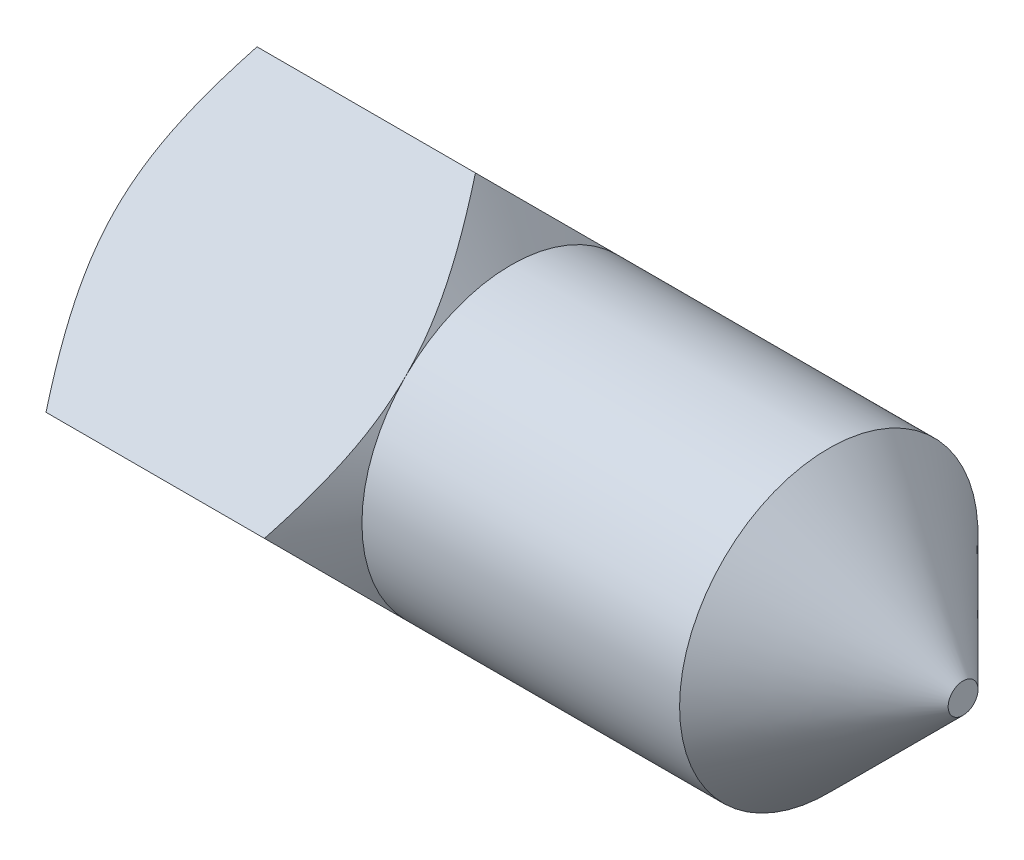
ISO-10303-21;
HEADER;
FILE_DESCRIPTION(('STEP AP214'),'2;1');
FILE_NAME('part.step','',(''),(''),'','','');
FILE_SCHEMA(('AUTOMOTIVE_DESIGN { 1 0 10303 214 1 1 1 1 }'));
ENDSEC;
DATA;
#1=APPLICATION_CONTEXT('core data for automotive mechanical design processes');
#2=APPLICATION_PROTOCOL_DEFINITION('international standard','automotive_design',2000,#1);
#3=PRODUCT_CONTEXT('',#1,'mechanical');
#4=PRODUCT('Part','Part','',(#3));
#5=PRODUCT_RELATED_PRODUCT_CATEGORY('part','',(#4));
#6=PRODUCT_DEFINITION_FORMATION('','',#4);
#7=PRODUCT_DEFINITION_CONTEXT('part definition',#1,'design');
#8=PRODUCT_DEFINITION('design','',#6,#7);
#9=PRODUCT_DEFINITION_SHAPE('','',#8);
#10=(LENGTH_UNIT() NAMED_UNIT(*) SI_UNIT(.MILLI.,.METRE.));
#11=(NAMED_UNIT(*) PLANE_ANGLE_UNIT() SI_UNIT($,.RADIAN.));
#12=(NAMED_UNIT(*) SI_UNIT($,.STERADIAN.) SOLID_ANGLE_UNIT());
#13=UNCERTAINTY_MEASURE_WITH_UNIT(LENGTH_MEASURE(1.E-05),#10,'distance_accuracy_value','');
#14=(GEOMETRIC_REPRESENTATION_CONTEXT(3) GLOBAL_UNCERTAINTY_ASSIGNED_CONTEXT((#13)) GLOBAL_UNIT_ASSIGNED_CONTEXT((#10,
#11,#12)) REPRESENTATION_CONTEXT('',''));
#15=CARTESIAN_POINT('',(0.,0.,0.));
#16=DIRECTION('',(0.,0.,1.));
#17=DIRECTION('',(1.,0.,0.));
#18=AXIS2_PLACEMENT_3D('',#15,#16,#17);
#19=CARTESIAN_POINT('',(0.,0.,0.));
#20=DIRECTION('',(-1.,0.,0.));
#21=DIRECTION('',(0.,0.,1.));
#22=AXIS2_PLACEMENT_3D('',#19,#20,#21);
#23=CYLINDRICAL_SURFACE('',#22,2.);
#24=CARTESIAN_POINT('',(3.94226497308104,0.,0.));
#25=DIRECTION('',(-1.,0.,0.));
#26=DIRECTION('',(0.,0.,1.));
#27=AXIS2_PLACEMENT_3D('',#24,#25,#26);
#28=CIRCLE('',#27,2.);
#29=CARTESIAN_POINT('',(3.9422649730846,1.41421356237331,1.41421356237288));
#30=VERTEX_POINT('',#29);
#31=CARTESIAN_POINT('',(3.94226497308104,1.41421356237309,-1.4142135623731));
#32=VERTEX_POINT('',#31);
#33=EDGE_CURVE('E11',#30,#32,#28,.T.);
#34=ORIENTED_EDGE('',*,*,#33,.F.);
#35=CARTESIAN_POINT('',(3.94226497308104,-1.41421356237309,1.4142135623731));
#36=VERTEX_POINT('',#35);
#37=EDGE_CURVE('E37',#36,#30,#28,.T.);
#38=ORIENTED_EDGE('',*,*,#37,.F.);
#39=CARTESIAN_POINT('',(3.94226497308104,-1.41421356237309,-1.4142135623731));
#40=VERTEX_POINT('',#39);
#41=EDGE_CURVE('E86',#40,#36,#28,.T.);
#42=ORIENTED_EDGE('',*,*,#41,.F.);
#43=EDGE_CURVE('E42',#32,#40,#28,.T.);
#44=ORIENTED_EDGE('',*,*,#43,.F.);
#45=EDGE_LOOP('',(#34,#38,#42,#44));
#46=FACE_BOUND('',#45,.T.);
#47=CARTESIAN_POINT('',(8.20000000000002,0.,0.));
#48=DIRECTION('',(-1.,0.,0.));
#49=DIRECTION('',(0.,0.,1.));
#50=AXIS2_PLACEMENT_3D('',#47,#48,#49);
#51=CIRCLE('',#50,2.);
#52=CARTESIAN_POINT('',(8.20000000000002,0.,2.));
#53=VERTEX_POINT('',#52);
#54=EDGE_CURVE('E221',#53,#53,#51,.T.);
#55=ORIENTED_EDGE('',*,*,#54,.T.);
#56=EDGE_LOOP('',(#55));
#57=FACE_BOUND('',#56,.T.);
#58=ADVANCED_FACE('F32',(#46,#57),#23,.T.);
#59=CARTESIAN_POINT('',(3.46397234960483,0.,0.));
#60=DIRECTION('',(-1.,0.,0.));
#61=DIRECTION('',(0.,0.,1.));
#62=AXIS2_PLACEMENT_3D('',#59,#60,#61);
#63=CONICAL_SURFACE('',#62,2.82842712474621,1.0471975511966);
#64=CARTESIAN_POINT('',(3.4638568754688,2.8286271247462,-0.000200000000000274));
#65=CARTESIAN_POINT('',(3.49161506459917,2.78053478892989,0.0478923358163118));
#66=CARTESIAN_POINT('',(3.51878504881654,2.7322683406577,0.0961587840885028));
#67=CARTESIAN_POINT('',(3.57167045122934,2.63532015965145,0.193106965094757));
#68=CARTESIAN_POINT('',(3.59738536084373,2.58663828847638,0.241788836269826));
#69=CARTESIAN_POINT('',(3.64721601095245,2.48852382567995,0.339903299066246));
#70=CARTESIAN_POINT('',(3.67132090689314,2.43908845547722,0.389338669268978));
#71=CARTESIAN_POINT('',(3.71737604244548,2.33972512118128,0.488702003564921));
#72=CARTESIAN_POINT('',(3.73932646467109,2.28979719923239,0.538629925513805));
#73=CARTESIAN_POINT('',(3.8006124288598,2.14090389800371,0.687523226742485));
#74=CARTESIAN_POINT('',(3.83626445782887,2.04114820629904,0.787278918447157));
#75=CARTESIAN_POINT('',(3.89354790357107,1.83980995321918,0.988617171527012));
#76=CARTESIAN_POINT('',(3.91521440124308,1.73823262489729,1.0901944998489));
#77=CARTESIAN_POINT('',(3.93895616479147,1.55061877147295,1.27780835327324));
#78=CARTESIAN_POINT('',(3.94365263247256,1.46475280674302,1.36367431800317));
#79=CARTESIAN_POINT('',(3.94015885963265,1.29311675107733,1.53531037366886));
#80=CARTESIAN_POINT('',(3.93196285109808,1.20734672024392,1.62108040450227));
#81=CARTESIAN_POINT('',(3.90378450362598,1.03666151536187,1.79176560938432));
#82=CARTESIAN_POINT('',(3.88378039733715,0.951748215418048,1.87667890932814));
#83=CARTESIAN_POINT('',(3.83421705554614,0.783348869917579,2.04507825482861));
#84=CARTESIAN_POINT('',(3.80465560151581,0.699863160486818,2.12856396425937));
#85=CARTESIAN_POINT('',(3.75037319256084,0.564467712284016,2.26395941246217));
#86=CARTESIAN_POINT('',(3.72780043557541,0.512114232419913,2.31631289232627));
#87=CARTESIAN_POINT('',(3.68024330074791,0.407975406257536,2.42045171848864));
#88=CARTESIAN_POINT('',(3.65525964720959,0.356189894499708,2.47223723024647));
#89=CARTESIAN_POINT('',(3.60344889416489,0.253386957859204,2.57504016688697));
#90=CARTESIAN_POINT('',(3.57663195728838,0.202366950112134,2.62606017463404));
#91=CARTESIAN_POINT('',(3.52137669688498,0.100767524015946,2.72765960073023));
#92=CARTESIAN_POINT('',(3.49293839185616,0.0501881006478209,2.77823902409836));
#93=CARTESIAN_POINT('',(3.46385687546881,-0.000200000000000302,2.82862712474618));
#94=B_SPLINE_CURVE_WITH_KNOTS('',3,(#64,#65,#66,#67,#68,#69,#70,#71,#72,#73,#74,#75,#76,#77,#78,
#79,#80,#81,#82,#83,#84,#85,#86,#87,#88,#89,#90,#91,#92,#93),.UNSPECIFIED.,.F.,.F.,(4,2,2,2,2,2,
2,2,2,2,2,2,2,2,4),(0.,0.220383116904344,0.440842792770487,0.662662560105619,0.884463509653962,
1.32047426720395,1.75538705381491,2.11928790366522,2.48335160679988,2.84808853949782,
3.21291019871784,3.4450819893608,3.67718424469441,3.90809048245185,4.13899408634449),.UNSPECIFIED.);
#95=CARTESIAN_POINT('',(3.46397234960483,2.82842712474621,0.));
#96=VERTEX_POINT('',#95);
#97=EDGE_CURVE('E109',#96,#30,#94,.T.);
#98=ORIENTED_EDGE('',*,*,#97,.T.);
#99=ORIENTED_EDGE('',*,*,#33,.T.);
#100=CARTESIAN_POINT('',(3.46385687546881,-0.000200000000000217,-2.82862712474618));
#101=CARTESIAN_POINT('',(3.49161506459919,0.0478923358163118,-2.78053478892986));
#102=CARTESIAN_POINT('',(3.51878504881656,0.0961587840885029,-2.73226834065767));
#103=CARTESIAN_POINT('',(3.57167045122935,0.193106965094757,-2.63532015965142));
#104=CARTESIAN_POINT('',(3.59738536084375,0.241788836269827,-2.58663828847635));
#105=CARTESIAN_POINT('',(3.64721601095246,0.339903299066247,-2.48852382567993));
#106=CARTESIAN_POINT('',(3.67132090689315,0.389338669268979,-2.4390884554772));
#107=CARTESIAN_POINT('',(3.71737604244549,0.488702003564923,-2.33972512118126));
#108=CARTESIAN_POINT('',(3.7393264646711,0.538629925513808,-2.28979719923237));
#109=CARTESIAN_POINT('',(3.80061242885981,0.687523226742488,-2.1409038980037));
#110=CARTESIAN_POINT('',(3.83626445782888,0.78727891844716,-2.04114820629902));
#111=CARTESIAN_POINT('',(3.89354790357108,0.988617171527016,-1.83980995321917));
#112=CARTESIAN_POINT('',(3.91521440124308,1.0901944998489,-1.73823262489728));
#113=CARTESIAN_POINT('',(3.93895616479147,1.27780835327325,-1.55061877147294));
#114=CARTESIAN_POINT('',(3.94365263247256,1.36367431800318,-1.46475280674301));
#115=CARTESIAN_POINT('',(3.94015885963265,1.53531037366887,-1.29311675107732));
#116=CARTESIAN_POINT('',(3.93196285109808,1.62108040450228,-1.20734672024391));
#117=CARTESIAN_POINT('',(3.90378450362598,1.79176560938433,-1.03666151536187));
#118=CARTESIAN_POINT('',(3.88378039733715,1.87667890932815,-0.951748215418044));
#119=CARTESIAN_POINT('',(3.83421705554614,2.04507825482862,-0.783348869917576));
#120=CARTESIAN_POINT('',(3.8046556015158,2.12856396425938,-0.699863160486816));
#121=CARTESIAN_POINT('',(3.75037319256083,2.26395941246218,-0.564467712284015));
#122=CARTESIAN_POINT('',(3.7278004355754,2.31631289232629,-0.512114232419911));
#123=CARTESIAN_POINT('',(3.6802433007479,2.42045171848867,-0.407975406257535));
#124=CARTESIAN_POINT('',(3.65525964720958,2.47223723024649,-0.356189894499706));
#125=CARTESIAN_POINT('',(3.60344889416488,2.575040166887,-0.253386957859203));
#126=CARTESIAN_POINT('',(3.57663195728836,2.62606017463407,-0.202366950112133));
#127=CARTESIAN_POINT('',(3.52137669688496,2.72765960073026,-0.100767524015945));
#128=CARTESIAN_POINT('',(3.49293839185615,2.77823902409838,-0.0501881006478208));
#129=CARTESIAN_POINT('',(3.4638568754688,2.8286271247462,0.000200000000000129));
#130=B_SPLINE_CURVE_WITH_KNOTS('',3,(#100,#101,#102,#103,#104,#105,#106,#107,#108,#109,#110,
#111,#112,#113,#114,#115,#116,#117,#118,#119,#120,#121,#122,#123,#124,#125,#126,#127,#128,#129),
.UNSPECIFIED.,.F.,.F.,(4,2,2,2,2,2,2,2,2,2,2,2,2,2,4),(0.,0.220383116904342,0.440842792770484,
0.662662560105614,0.884463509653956,1.32047426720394,1.75538705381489,2.11928790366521,
2.48335160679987,2.84808853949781,3.21291019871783,3.4450819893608,3.67718424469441,
3.90809048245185,4.13899408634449),.UNSPECIFIED.);
#131=EDGE_CURVE('E147',#32,#96,#130,.T.);
#132=ORIENTED_EDGE('',*,*,#131,.T.);
#133=EDGE_LOOP('',(#98,#99,#132));
#134=FACE_BOUND('',#133,.T.);
#135=ADVANCED_FACE('F126',(#134),#63,.T.);
#136=CARTESIAN_POINT('',(3.46397234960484,0.,-2.82842712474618));
#137=VERTEX_POINT('',#136);
#138=EDGE_CURVE('E140',#137,#32,#130,.T.);
#139=ORIENTED_EDGE('',*,*,#138,.T.);
#140=ORIENTED_EDGE('',*,*,#43,.T.);
#141=CARTESIAN_POINT('',(3.4638568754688,-2.8286271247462,0.000199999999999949));
#142=CARTESIAN_POINT('',(3.49161506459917,-2.78053478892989,-0.0478923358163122));
#143=CARTESIAN_POINT('',(3.51878504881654,-2.7322683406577,-0.0961587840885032));
#144=CARTESIAN_POINT('',(3.57167045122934,-2.63532015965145,-0.193106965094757));
#145=CARTESIAN_POINT('',(3.59738536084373,-2.58663828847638,-0.241788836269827));
#146=CARTESIAN_POINT('',(3.64721601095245,-2.48852382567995,-0.339903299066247));
#147=CARTESIAN_POINT('',(3.67132090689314,-2.43908845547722,-0.389338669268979));
#148=CARTESIAN_POINT('',(3.71737604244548,-2.33972512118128,-0.488702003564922));
#149=CARTESIAN_POINT('',(3.73932646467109,-2.28979719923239,-0.538629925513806));
#150=CARTESIAN_POINT('',(3.8006124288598,-2.14090389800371,-0.687523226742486));
#151=CARTESIAN_POINT('',(3.83626445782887,-2.04114820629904,-0.787278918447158));
#152=CARTESIAN_POINT('',(3.89354790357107,-1.83980995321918,-0.988617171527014));
#153=CARTESIAN_POINT('',(3.91521440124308,-1.73823262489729,-1.0901944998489));
#154=CARTESIAN_POINT('',(3.93895616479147,-1.55061877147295,-1.27780835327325));
#155=CARTESIAN_POINT('',(3.94365263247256,-1.46475280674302,-1.36367431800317));
#156=CARTESIAN_POINT('',(3.94015885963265,-1.29311675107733,-1.53531037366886));
#157=CARTESIAN_POINT('',(3.93196285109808,-1.20734672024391,-1.62108040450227));
#158=CARTESIAN_POINT('',(3.90378450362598,-1.03666151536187,-1.79176560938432));
#159=CARTESIAN_POINT('',(3.88378039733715,-0.951748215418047,-1.87667890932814));
#160=CARTESIAN_POINT('',(3.83421705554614,-0.783348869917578,-2.04507825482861));
#161=CARTESIAN_POINT('',(3.80465560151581,-0.699863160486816,-2.12856396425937));
#162=CARTESIAN_POINT('',(3.75037319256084,-0.564467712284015,-2.26395941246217));
#163=CARTESIAN_POINT('',(3.72780043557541,-0.512114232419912,-2.31631289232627));
#164=CARTESIAN_POINT('',(3.68024330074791,-0.407975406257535,-2.42045171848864));
#165=CARTESIAN_POINT('',(3.65525964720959,-0.356189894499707,-2.47223723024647));
#166=CARTESIAN_POINT('',(3.60344889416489,-0.253386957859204,-2.57504016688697));
#167=CARTESIAN_POINT('',(3.57663195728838,-0.202366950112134,-2.62606017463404));
#168=CARTESIAN_POINT('',(3.52137669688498,-0.100767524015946,-2.72765960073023));
#169=CARTESIAN_POINT('',(3.49293839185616,-0.0501881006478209,-2.77823902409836));
#170=CARTESIAN_POINT('',(3.46385687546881,0.000200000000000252,-2.82862712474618));
#171=B_SPLINE_CURVE_WITH_KNOTS('',3,(#141,#142,#143,#144,#145,#146,#147,#148,#149,#150,#151,
#152,#153,#154,#155,#156,#157,#158,#159,#160,#161,#162,#163,#164,#165,#166,#167,#168,#169,#170),
.UNSPECIFIED.,.F.,.F.,(4,2,2,2,2,2,2,2,2,2,2,2,2,2,4),(0.,0.220383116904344,0.440842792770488,
0.66266256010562,0.884463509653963,1.32047426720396,1.75538705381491,2.11928790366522,
2.48335160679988,2.84808853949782,3.21291019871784,3.44508198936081,3.67718424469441,
3.90809048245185,4.13899408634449),.UNSPECIFIED.);
#172=EDGE_CURVE('E55',#40,#137,#171,.T.);
#173=ORIENTED_EDGE('',*,*,#172,.T.);
#174=EDGE_LOOP('',(#139,#140,#173));
#175=FACE_BOUND('',#174,.T.);
#176=ADVANCED_FACE('F131',(#175),#63,.T.);
#177=CARTESIAN_POINT('',(3.46397234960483,-2.82842712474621,0.));
#178=VERTEX_POINT('',#177);
#179=EDGE_CURVE('E97',#178,#40,#171,.T.);
#180=ORIENTED_EDGE('',*,*,#179,.T.);
#181=ORIENTED_EDGE('',*,*,#41,.T.);
#182=CARTESIAN_POINT('',(3.46385687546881,0.000199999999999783,2.82862712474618));
#183=CARTESIAN_POINT('',(3.49161506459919,-0.0478923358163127,2.78053478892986));
#184=CARTESIAN_POINT('',(3.51878504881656,-0.0961587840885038,2.73226834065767));
#185=CARTESIAN_POINT('',(3.57167045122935,-0.193106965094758,2.63532015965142));
#186=CARTESIAN_POINT('',(3.59738536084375,-0.241788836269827,2.58663828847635));
#187=CARTESIAN_POINT('',(3.64721601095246,-0.339903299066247,2.48852382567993));
#188=CARTESIAN_POINT('',(3.67132090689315,-0.38933866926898,2.4390884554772));
#189=CARTESIAN_POINT('',(3.71737604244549,-0.488702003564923,2.33972512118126));
#190=CARTESIAN_POINT('',(3.7393264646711,-0.538629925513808,2.28979719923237));
#191=CARTESIAN_POINT('',(3.80061242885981,-0.687523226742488,2.1409038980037));
#192=CARTESIAN_POINT('',(3.83626445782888,-0.787278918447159,2.04114820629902));
#193=CARTESIAN_POINT('',(3.89354790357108,-0.988617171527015,1.83980995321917));
#194=CARTESIAN_POINT('',(3.91521440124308,-1.0901944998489,1.73823262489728));
#195=CARTESIAN_POINT('',(3.93895616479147,-1.27780835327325,1.55061877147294));
#196=CARTESIAN_POINT('',(3.94365263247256,-1.36367431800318,1.46475280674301));
#197=CARTESIAN_POINT('',(3.94015885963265,-1.53531037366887,1.29311675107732));
#198=CARTESIAN_POINT('',(3.93196285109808,-1.62108040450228,1.20734672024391));
#199=CARTESIAN_POINT('',(3.90378450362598,-1.79176560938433,1.03666151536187));
#200=CARTESIAN_POINT('',(3.88378039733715,-1.87667890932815,0.951748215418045));
#201=CARTESIAN_POINT('',(3.83421705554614,-2.04507825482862,0.783348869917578));
#202=CARTESIAN_POINT('',(3.8046556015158,-2.12856396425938,0.699863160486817));
#203=CARTESIAN_POINT('',(3.75037319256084,-2.26395941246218,0.564467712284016));
#204=CARTESIAN_POINT('',(3.7278004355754,-2.31631289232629,0.512114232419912));
#205=CARTESIAN_POINT('',(3.6802433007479,-2.42045171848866,0.407975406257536));
#206=CARTESIAN_POINT('',(3.65525964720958,-2.47223723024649,0.356189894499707));
#207=CARTESIAN_POINT('',(3.60344889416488,-2.575040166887,0.253386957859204));
#208=CARTESIAN_POINT('',(3.57663195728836,-2.62606017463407,0.202366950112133));
#209=CARTESIAN_POINT('',(3.52137669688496,-2.72765960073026,0.100767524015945));
#210=CARTESIAN_POINT('',(3.49293839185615,-2.77823902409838,0.0501881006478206));
#211=CARTESIAN_POINT('',(3.4638568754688,-2.8286271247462,-0.000200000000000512));
#212=B_SPLINE_CURVE_WITH_KNOTS('',3,(#182,#183,#184,#185,#186,#187,#188,#189,#190,#191,#192,
#193,#194,#195,#196,#197,#198,#199,#200,#201,#202,#203,#204,#205,#206,#207,#208,#209,#210,#211),
.UNSPECIFIED.,.F.,.F.,(4,2,2,2,2,2,2,2,2,2,2,2,2,2,4),(0.,0.220383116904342,0.440842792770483,
0.662662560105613,0.884463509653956,1.32047426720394,1.75538705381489,2.1192879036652,
2.48335160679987,2.8480885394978,3.21291019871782,3.4450819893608,3.67718424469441,
3.90809048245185,4.13899408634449),.UNSPECIFIED.);
#213=EDGE_CURVE('E95',#36,#178,#212,.T.);
#214=ORIENTED_EDGE('',*,*,#213,.T.);
#215=EDGE_LOOP('',(#180,#181,#214));
#216=FACE_BOUND('',#215,.T.);
#217=ADVANCED_FACE('F94',(#216),#63,.T.);
#218=CARTESIAN_POINT('',(3.46397234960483,0.,2.82842712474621));
#219=VERTEX_POINT('',#218);
#220=EDGE_CURVE('E102',#219,#36,#212,.T.);
#221=ORIENTED_EDGE('',*,*,#220,.T.);
#222=ORIENTED_EDGE('',*,*,#37,.T.);
#223=EDGE_CURVE('E108',#30,#219,#94,.T.);
#224=ORIENTED_EDGE('',*,*,#223,.T.);
#225=EDGE_LOOP('',(#221,#222,#224));
#226=FACE_BOUND('',#225,.T.);
#227=ADVANCED_FACE('F107',(#226),#63,.T.);
#228=CARTESIAN_POINT('',(4.,2.8284271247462,0.));
#229=DIRECTION('',(0.,-0.707106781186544,-0.707106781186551));
#230=DIRECTION('',(0.,0.707106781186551,-0.707106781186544));
#231=AXIS2_PLACEMENT_3D('',#228,#229,#230);
#232=PLANE('',#231);
#233=ORIENTED_EDGE('',*,*,#223,.F.);
#234=ORIENTED_EDGE('',*,*,#97,.F.);
#235=DIRECTION('',(-1.,0.,0.));
#236=VECTOR('',#235,1.);
#237=CARTESIAN_POINT('',(4.,2.8284271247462,0.));
#238=LINE('',#237,#236);
#239=CARTESIAN_POINT('',(0.536027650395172,2.8284271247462,0.));
#240=VERTEX_POINT('',#239);
#241=EDGE_CURVE('E184',#96,#240,#238,.T.);
#242=ORIENTED_EDGE('',*,*,#241,.T.);
#243=CARTESIAN_POINT('',(0.536143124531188,-0.000200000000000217,2.82862712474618));
#244=CARTESIAN_POINT('',(0.508384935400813,0.0478923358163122,2.78053478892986));
#245=CARTESIAN_POINT('',(0.481214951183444,0.0961587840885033,2.73226834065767));
#246=CARTESIAN_POINT('',(0.428329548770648,0.193106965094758,2.63532015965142));
#247=CARTESIAN_POINT('',(0.402614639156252,0.241788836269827,2.58663828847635));
#248=CARTESIAN_POINT('',(0.352783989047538,0.339903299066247,2.48852382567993));
#249=CARTESIAN_POINT('',(0.328679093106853,0.389338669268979,2.4390884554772));
#250=CARTESIAN_POINT('',(0.282623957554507,0.488702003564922,2.33972512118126));
#251=CARTESIAN_POINT('',(0.260673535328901,0.538629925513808,2.28979719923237));
#252=CARTESIAN_POINT('',(0.199387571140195,0.687523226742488,2.1409038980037));
#253=CARTESIAN_POINT('',(0.163735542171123,0.787278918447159,2.04114820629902));
#254=CARTESIAN_POINT('',(0.106452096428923,0.988617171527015,1.83980995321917));
#255=CARTESIAN_POINT('',(0.0847855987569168,1.0901944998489,1.73823262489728));
#256=CARTESIAN_POINT('',(0.0610438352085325,1.27780835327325,1.55061877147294));
#257=CARTESIAN_POINT('',(0.0563473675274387,1.36367431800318,1.46475280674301));
#258=CARTESIAN_POINT('',(0.0598411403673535,1.53531037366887,1.29311675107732));
#259=CARTESIAN_POINT('',(0.0680371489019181,1.62108040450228,1.20734672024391));
#260=CARTESIAN_POINT('',(0.0962154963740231,1.79176560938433,1.03666151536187));
#261=CARTESIAN_POINT('',(0.116219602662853,1.87667890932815,0.951748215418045));
#262=CARTESIAN_POINT('',(0.165782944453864,2.04507825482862,0.783348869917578));
#263=CARTESIAN_POINT('',(0.195344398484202,2.12856396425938,0.699863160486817));
#264=CARTESIAN_POINT('',(0.249626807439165,2.26395941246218,0.564467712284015));
#265=CARTESIAN_POINT('',(0.272199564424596,2.31631289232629,0.512114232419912));
#266=CARTESIAN_POINT('',(0.319756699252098,2.42045171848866,0.407975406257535));
#267=CARTESIAN_POINT('',(0.344740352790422,2.47223723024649,0.356189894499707));
#268=CARTESIAN_POINT('',(0.396551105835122,2.575040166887,0.253386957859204));
#269=CARTESIAN_POINT('',(0.423368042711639,2.62606017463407,0.202366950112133));
#270=CARTESIAN_POINT('',(0.478623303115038,2.72765960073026,0.100767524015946));
#271=CARTESIAN_POINT('',(0.507061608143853,2.77823902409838,0.050188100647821));
#272=CARTESIAN_POINT('',(0.536143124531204,2.8286271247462,-0.000200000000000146));
#273=B_SPLINE_CURVE_WITH_KNOTS('',3,(#243,#244,#245,#246,#247,#248,#249,#250,#251,#252,#253,
#254,#255,#256,#257,#258,#259,#260,#261,#262,#263,#264,#265,#266,#267,#268,#269,#270,#271,#272),
.UNSPECIFIED.,.F.,.F.,(4,2,2,2,2,2,2,2,2,2,2,2,2,2,4),(0.,0.220383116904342,0.440842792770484,
0.662662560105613,0.884463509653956,1.32047426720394,1.75538705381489,2.11928790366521,
2.48335160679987,2.8480885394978,3.21291019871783,3.4450819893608,3.67718424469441,
3.90809048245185,4.13899408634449),.UNSPECIFIED.);
#274=CARTESIAN_POINT('',(0.536027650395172,0.,2.8284271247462));
#275=VERTEX_POINT('',#274);
#276=EDGE_CURVE('E178',#275,#240,#273,.T.);
#277=ORIENTED_EDGE('',*,*,#276,.F.);
#278=DIRECTION('',(-1.,0.,0.));
#279=VECTOR('',#278,1.);
#280=CARTESIAN_POINT('',(4.,0.,2.82842712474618));
#281=LINE('',#280,#279);
#282=EDGE_CURVE('E90',#219,#275,#281,.T.);
#283=ORIENTED_EDGE('',*,*,#282,.F.);
#284=EDGE_LOOP('',(#233,#234,#242,#277,#283));
#285=FACE_BOUND('',#284,.T.);
#286=ADVANCED_FACE('F34',(#285),#232,.F.);
#287=CARTESIAN_POINT('',(4.,-2.8284271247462,0.));
#288=DIRECTION('',(0.,0.707106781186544,-0.707106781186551));
#289=DIRECTION('',(0.,0.707106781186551,0.707106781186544));
#290=AXIS2_PLACEMENT_3D('',#287,#288,#289);
#291=PLANE('',#290);
#292=ORIENTED_EDGE('',*,*,#213,.F.);
#293=ORIENTED_EDGE('',*,*,#220,.F.);
#294=ORIENTED_EDGE('',*,*,#282,.T.);
#295=CARTESIAN_POINT('',(0.536143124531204,-2.8286271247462,-0.000200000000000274));
#296=CARTESIAN_POINT('',(0.508384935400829,-2.78053478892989,0.0478923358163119));
#297=CARTESIAN_POINT('',(0.481214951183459,-2.7322683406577,0.0961587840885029));
#298=CARTESIAN_POINT('',(0.428329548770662,-2.63532015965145,0.193106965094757));
#299=CARTESIAN_POINT('',(0.402614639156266,-2.58663828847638,0.241788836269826));
#300=CARTESIAN_POINT('',(0.352783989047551,-2.48852382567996,0.339903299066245));
#301=CARTESIAN_POINT('',(0.328679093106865,-2.43908845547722,0.389338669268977));
#302=CARTESIAN_POINT('',(0.282623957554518,-2.33972512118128,0.48870200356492));
#303=CARTESIAN_POINT('',(0.260673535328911,-2.28979719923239,0.538629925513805));
#304=CARTESIAN_POINT('',(0.199387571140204,-2.14090389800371,0.687523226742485));
#305=CARTESIAN_POINT('',(0.16373554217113,-2.04114820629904,0.787278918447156));
#306=CARTESIAN_POINT('',(0.106452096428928,-1.83980995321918,0.988617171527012));
#307=CARTESIAN_POINT('',(0.0847855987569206,-1.73823262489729,1.0901944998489));
#308=CARTESIAN_POINT('',(0.0610438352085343,-1.55061877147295,1.27780835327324));
#309=CARTESIAN_POINT('',(0.0563473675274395,-1.46475280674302,1.36367431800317));
#310=CARTESIAN_POINT('',(0.0598411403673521,-1.29311675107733,1.53531037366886));
#311=CARTESIAN_POINT('',(0.0680371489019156,-1.20734672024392,1.62108040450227));
#312=CARTESIAN_POINT('',(0.0962154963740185,-1.03666151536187,1.79176560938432));
#313=CARTESIAN_POINT('',(0.116219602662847,-0.951748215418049,1.87667890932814));
#314=CARTESIAN_POINT('',(0.165782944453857,-0.78334886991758,2.0450782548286));
#315=CARTESIAN_POINT('',(0.195344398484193,-0.699863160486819,2.12856396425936));
#316=CARTESIAN_POINT('',(0.249626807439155,-0.564467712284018,2.26395941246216));
#317=CARTESIAN_POINT('',(0.272199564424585,-0.512114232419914,2.31631289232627));
#318=CARTESIAN_POINT('',(0.319756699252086,-0.407975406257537,2.42045171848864));
#319=CARTESIAN_POINT('',(0.34474035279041,-0.356189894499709,2.47223723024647));
#320=CARTESIAN_POINT('',(0.396551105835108,-0.253386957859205,2.57504016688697));
#321=CARTESIAN_POINT('',(0.423368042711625,-0.202366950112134,2.62606017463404));
#322=CARTESIAN_POINT('',(0.478623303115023,-0.100767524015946,2.72765960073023));
#323=CARTESIAN_POINT('',(0.507061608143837,-0.0501881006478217,2.77823902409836));
#324=CARTESIAN_POINT('',(0.536143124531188,0.000200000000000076,2.82862712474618));
#325=B_SPLINE_CURVE_WITH_KNOTS('',3,(#295,#296,#297,#298,#299,#300,#301,#302,#303,#304,#305,
#306,#307,#308,#309,#310,#311,#312,#313,#314,#315,#316,#317,#318,#319,#320,#321,#322,#323,#324),
.UNSPECIFIED.,.F.,.F.,(4,2,2,2,2,2,2,2,2,2,2,2,2,2,4),(0.,0.220383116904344,0.440842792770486,
0.662662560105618,0.884463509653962,1.32047426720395,1.75538705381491,2.11928790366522,
2.48335160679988,2.84808853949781,3.21291019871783,3.4450819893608,3.67718424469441,
3.90809048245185,4.13899408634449),.UNSPECIFIED.);
#326=CARTESIAN_POINT('',(0.536027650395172,-2.8284271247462,0.));
#327=VERTEX_POINT('',#326);
#328=EDGE_CURVE('E172',#327,#275,#325,.T.);
#329=ORIENTED_EDGE('',*,*,#328,.F.);
#330=DIRECTION('',(-1.,0.,0.));
#331=VECTOR('',#330,1.);
#332=CARTESIAN_POINT('',(4.,-2.8284271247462,0.));
#333=LINE('',#332,#331);
#334=EDGE_CURVE('E105',#178,#327,#333,.T.);
#335=ORIENTED_EDGE('',*,*,#334,.F.);
#336=EDGE_LOOP('',(#292,#293,#294,#329,#335));
#337=FACE_BOUND('',#336,.T.);
#338=ADVANCED_FACE('F101',(#337),#291,.F.);
#339=CARTESIAN_POINT('',(4.,-2.8284271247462,0.));
#340=DIRECTION('',(0.,0.707106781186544,0.707106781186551));
#341=DIRECTION('',(0.,-0.707106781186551,0.707106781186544));
#342=AXIS2_PLACEMENT_3D('',#339,#340,#341);
#343=PLANE('',#342);
#344=ORIENTED_EDGE('',*,*,#172,.F.);
#345=ORIENTED_EDGE('',*,*,#179,.F.);
#346=ORIENTED_EDGE('',*,*,#334,.T.);
#347=CARTESIAN_POINT('',(0.536143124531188,0.000199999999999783,-2.82862712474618));
#348=CARTESIAN_POINT('',(0.508384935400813,-0.0478923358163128,-2.78053478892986));
#349=CARTESIAN_POINT('',(0.481214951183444,-0.0961587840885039,-2.73226834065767));
#350=CARTESIAN_POINT('',(0.428329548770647,-0.193106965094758,-2.63532015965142));
#351=CARTESIAN_POINT('',(0.402614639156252,-0.241788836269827,-2.58663828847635));
#352=CARTESIAN_POINT('',(0.352783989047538,-0.339903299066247,-2.48852382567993));
#353=CARTESIAN_POINT('',(0.328679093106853,-0.38933866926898,-2.4390884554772));
#354=CARTESIAN_POINT('',(0.282623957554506,-0.488702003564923,-2.33972512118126));
#355=CARTESIAN_POINT('',(0.2606735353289,-0.538629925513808,-2.28979719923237));
#356=CARTESIAN_POINT('',(0.199387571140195,-0.687523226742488,-2.1409038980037));
#357=CARTESIAN_POINT('',(0.163735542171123,-0.787278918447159,-2.04114820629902));
#358=CARTESIAN_POINT('',(0.106452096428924,-0.988617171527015,-1.83980995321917));
#359=CARTESIAN_POINT('',(0.0847855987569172,-1.0901944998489,-1.73823262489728));
#360=CARTESIAN_POINT('',(0.0610438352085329,-1.27780835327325,-1.55061877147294));
#361=CARTESIAN_POINT('',(0.0563473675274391,-1.36367431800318,-1.46475280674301));
#362=CARTESIAN_POINT('',(0.0598411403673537,-1.53531037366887,-1.29311675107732));
#363=CARTESIAN_POINT('',(0.0680371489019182,-1.62108040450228,-1.20734672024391));
#364=CARTESIAN_POINT('',(0.0962154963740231,-1.79176560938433,-1.03666151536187));
#365=CARTESIAN_POINT('',(0.116219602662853,-1.87667890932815,-0.951748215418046));
#366=CARTESIAN_POINT('',(0.165782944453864,-2.04507825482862,-0.783348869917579));
#367=CARTESIAN_POINT('',(0.195344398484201,-2.12856396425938,-0.699863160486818));
#368=CARTESIAN_POINT('',(0.249626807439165,-2.26395941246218,-0.564467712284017));
#369=CARTESIAN_POINT('',(0.272199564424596,-2.31631289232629,-0.512114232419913));
#370=CARTESIAN_POINT('',(0.319756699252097,-2.42045171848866,-0.407975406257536));
#371=CARTESIAN_POINT('',(0.344740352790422,-2.47223723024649,-0.356189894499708));
#372=CARTESIAN_POINT('',(0.396551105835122,-2.575040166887,-0.253386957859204));
#373=CARTESIAN_POINT('',(0.423368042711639,-2.62606017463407,-0.202366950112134));
#374=CARTESIAN_POINT('',(0.478623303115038,-2.72765960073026,-0.100767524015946));
#375=CARTESIAN_POINT('',(0.507061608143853,-2.77823902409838,-0.0501881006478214));
#376=CARTESIAN_POINT('',(0.536143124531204,-2.8286271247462,0.000199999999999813));
#377=B_SPLINE_CURVE_WITH_KNOTS('',3,(#347,#348,#349,#350,#351,#352,#353,#354,#355,#356,#357,
#358,#359,#360,#361,#362,#363,#364,#365,#366,#367,#368,#369,#370,#371,#372,#373,#374,#375,#376),
.UNSPECIFIED.,.F.,.F.,(4,2,2,2,2,2,2,2,2,2,2,2,2,2,4),(0.,0.220383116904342,0.440842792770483,
0.662662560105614,0.884463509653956,1.32047426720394,1.75538705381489,2.1192879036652,
2.48335160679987,2.8480885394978,3.21291019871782,3.4450819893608,3.6771842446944,
3.90809048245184,4.13899408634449),.UNSPECIFIED.);
#378=CARTESIAN_POINT('',(0.536027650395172,0.,-2.8284271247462));
#379=VERTEX_POINT('',#378);
#380=EDGE_CURVE('E165',#379,#327,#377,.T.);
#381=ORIENTED_EDGE('',*,*,#380,.F.);
#382=DIRECTION('',(-1.,0.,0.));
#383=VECTOR('',#382,1.);
#384=CARTESIAN_POINT('',(4.,0.,-2.82842712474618));
#385=LINE('',#384,#383);
#386=EDGE_CURVE('E186',#137,#379,#385,.T.);
#387=ORIENTED_EDGE('',*,*,#386,.F.);
#388=EDGE_LOOP('',(#344,#345,#346,#381,#387));
#389=FACE_BOUND('',#388,.T.);
#390=ADVANCED_FACE('F153',(#389),#343,.F.);
#391=CARTESIAN_POINT('',(4.,2.8284271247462,0.));
#392=DIRECTION('',(0.,-0.707106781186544,0.707106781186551));
#393=DIRECTION('',(0.,-0.707106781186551,-0.707106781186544));
#394=AXIS2_PLACEMENT_3D('',#391,#392,#393);
#395=PLANE('',#394);
#396=ORIENTED_EDGE('',*,*,#131,.F.);
#397=ORIENTED_EDGE('',*,*,#138,.F.);
#398=ORIENTED_EDGE('',*,*,#386,.T.);
#399=CARTESIAN_POINT('',(0.536143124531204,2.8286271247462,0.000199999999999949));
#400=CARTESIAN_POINT('',(0.508384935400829,2.78053478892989,-0.0478923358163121));
#401=CARTESIAN_POINT('',(0.481214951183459,2.7322683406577,-0.0961587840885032));
#402=CARTESIAN_POINT('',(0.428329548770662,2.63532015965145,-0.193106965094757));
#403=CARTESIAN_POINT('',(0.402614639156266,2.58663828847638,-0.241788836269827));
#404=CARTESIAN_POINT('',(0.352783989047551,2.48852382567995,-0.339903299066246));
#405=CARTESIAN_POINT('',(0.328679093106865,2.43908845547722,-0.389338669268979));
#406=CARTESIAN_POINT('',(0.282623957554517,2.33972512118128,-0.488702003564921));
#407=CARTESIAN_POINT('',(0.260673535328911,2.28979719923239,-0.538629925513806));
#408=CARTESIAN_POINT('',(0.199387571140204,2.14090389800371,-0.687523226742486));
#409=CARTESIAN_POINT('',(0.16373554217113,2.04114820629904,-0.787278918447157));
#410=CARTESIAN_POINT('',(0.106452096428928,1.83980995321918,-0.988617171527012));
#411=CARTESIAN_POINT('',(0.0847855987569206,1.73823262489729,-1.0901944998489));
#412=CARTESIAN_POINT('',(0.0610438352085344,1.55061877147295,-1.27780835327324));
#413=CARTESIAN_POINT('',(0.0563473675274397,1.46475280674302,-1.36367431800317));
#414=CARTESIAN_POINT('',(0.0598411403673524,1.29311675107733,-1.53531037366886));
#415=CARTESIAN_POINT('',(0.0680371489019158,1.20734672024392,-1.62108040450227));
#416=CARTESIAN_POINT('',(0.0962154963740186,1.03666151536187,-1.79176560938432));
#417=CARTESIAN_POINT('',(0.116219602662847,0.951748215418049,-1.87667890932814));
#418=CARTESIAN_POINT('',(0.165782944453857,0.783348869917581,-2.0450782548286));
#419=CARTESIAN_POINT('',(0.195344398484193,0.69986316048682,-2.12856396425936));
#420=CARTESIAN_POINT('',(0.249626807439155,0.564467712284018,-2.26395941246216));
#421=CARTESIAN_POINT('',(0.272199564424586,0.512114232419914,-2.31631289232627));
#422=CARTESIAN_POINT('',(0.319756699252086,0.407975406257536,-2.42045171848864));
#423=CARTESIAN_POINT('',(0.34474035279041,0.356189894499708,-2.47223723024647));
#424=CARTESIAN_POINT('',(0.396551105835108,0.253386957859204,-2.57504016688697));
#425=CARTESIAN_POINT('',(0.423368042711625,0.202366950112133,-2.62606017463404));
#426=CARTESIAN_POINT('',(0.478623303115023,0.100767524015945,-2.72765960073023));
#427=CARTESIAN_POINT('',(0.507061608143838,0.0501881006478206,-2.77823902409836));
#428=CARTESIAN_POINT('',(0.536143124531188,-0.000200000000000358,-2.82862712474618));
#429=B_SPLINE_CURVE_WITH_KNOTS('',3,(#399,#400,#401,#402,#403,#404,#405,#406,#407,#408,#409,
#410,#411,#412,#413,#414,#415,#416,#417,#418,#419,#420,#421,#422,#423,#424,#425,#426,#427,#428),
.UNSPECIFIED.,.F.,.F.,(4,2,2,2,2,2,2,2,2,2,2,2,2,2,4),(0.,0.220383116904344,0.440842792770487,
0.662662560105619,0.884463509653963,1.32047426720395,1.75538705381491,2.11928790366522,
2.48335160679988,2.84808853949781,3.21291019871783,3.4450819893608,3.67718424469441,
3.90809048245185,4.13899408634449),.UNSPECIFIED.);
#430=EDGE_CURVE('E159',#240,#379,#429,.T.);
#431=ORIENTED_EDGE('',*,*,#430,.F.);
#432=ORIENTED_EDGE('',*,*,#241,.F.);
#433=EDGE_LOOP('',(#396,#397,#398,#431,#432));
#434=FACE_BOUND('',#433,.T.);
#435=ADVANCED_FACE('F150',(#434),#395,.F.);
#436=CARTESIAN_POINT('',(0.,0.,0.));
#437=DIRECTION('',(1.,0.,0.));
#438=DIRECTION('',(0.,0.,-1.));
#439=AXIS2_PLACEMENT_3D('',#436,#437,#438);
#440=CONICAL_SURFACE('',#439,1.9,1.0471975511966);
#441=CARTESIAN_POINT('',(0.,0.,0.));
#442=DIRECTION('',(-1.,0.,0.));
#443=DIRECTION('',(0.,0.,1.));
#444=AXIS2_PLACEMENT_3D('',#441,#442,#443);
#445=CIRCLE('',#444,1.9);
#446=CARTESIAN_POINT('',(0.,0.,1.9));
#447=VERTEX_POINT('',#446);
#448=EDGE_CURVE('E166',#447,#447,#445,.T.);
#449=ORIENTED_EDGE('',*,*,#448,.F.);
#450=EDGE_LOOP('',(#449));
#451=FACE_BOUND('',#450,.T.);
#452=ORIENTED_EDGE('',*,*,#276,.T.);
#453=ORIENTED_EDGE('',*,*,#430,.T.);
#454=ORIENTED_EDGE('',*,*,#380,.T.);
#455=ORIENTED_EDGE('',*,*,#328,.T.);
#456=EDGE_LOOP('',(#452,#453,#454,#455));
#457=FACE_BOUND('',#456,.T.);
#458=ADVANCED_FACE('F135',(#451,#457),#440,.T.);
#459=CARTESIAN_POINT('',(0.,0.,2.82842712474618));
#460=DIRECTION('',(-1.,0.,0.));
#461=DIRECTION('',(0.,0.,1.));
#462=AXIS2_PLACEMENT_3D('',#459,#460,#461);
#463=PLANE('',#462);
#464=ORIENTED_EDGE('',*,*,#448,.T.);
#465=EDGE_LOOP('',(#464));
#466=FACE_BOUND('',#465,.T.);
#467=ADVANCED_FACE('F155',(#466),#463,.T.);
#468=CARTESIAN_POINT('',(8.20000000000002,0.,0.));
#469=DIRECTION('',(-1.,0.,0.));
#470=DIRECTION('',(0.,0.,1.));
#471=AXIS2_PLACEMENT_3D('',#468,#469,#470);
#472=CONICAL_SURFACE('',#471,2.,0.785398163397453);
#473=CARTESIAN_POINT('',(10.,0.,0.));
#474=DIRECTION('',(-1.,0.,0.));
#475=DIRECTION('',(0.,0.,1.));
#476=AXIS2_PLACEMENT_3D('',#473,#474,#475);
#477=CIRCLE('',#476,0.2);
#478=CARTESIAN_POINT('',(10.,0.,0.199999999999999));
#479=VERTEX_POINT('',#478);
#480=EDGE_CURVE('E148',#479,#479,#477,.T.);
#481=CARTESIAN_POINT('',(10.,0.,0.199999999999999));
#482=CARTESIAN_POINT('',(9.98125,0.,0.218749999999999));
#483=CARTESIAN_POINT('',(9.9625,0.,0.237499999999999));
#484=CARTESIAN_POINT('',(9.925,0.,0.274999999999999));
#485=CARTESIAN_POINT('',(9.90625,0.,0.293749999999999));
#486=CARTESIAN_POINT('',(9.86875,0.,0.331249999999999));
#487=CARTESIAN_POINT('',(9.85,0.,0.349999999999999));
#488=CARTESIAN_POINT('',(9.8125,0.,0.387499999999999));
#489=CARTESIAN_POINT('',(9.79375,0.,0.406249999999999));
#490=CARTESIAN_POINT('',(9.75625,0.,0.443749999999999));
#491=CARTESIAN_POINT('',(9.7375,0.,0.462499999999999));
#492=CARTESIAN_POINT('',(9.7,0.,0.499999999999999));
#493=CARTESIAN_POINT('',(9.68125,0.,0.518749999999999));
#494=CARTESIAN_POINT('',(9.64375,0.,0.556249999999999));
#495=CARTESIAN_POINT('',(9.625,0.,0.574999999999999));
#496=CARTESIAN_POINT('',(9.5875,0.,0.612499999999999));
#497=CARTESIAN_POINT('',(9.56875,0.,0.631249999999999));
#498=CARTESIAN_POINT('',(9.53125,0.,0.668749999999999));
#499=CARTESIAN_POINT('',(9.5125,0.,0.687499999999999));
#500=CARTESIAN_POINT('',(9.475,0.,0.724999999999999));
#501=CARTESIAN_POINT('',(9.45625,0.,0.743749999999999));
#502=CARTESIAN_POINT('',(9.41875,0.,0.781249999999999));
#503=CARTESIAN_POINT('',(9.40000000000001,0.,0.799999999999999));
#504=CARTESIAN_POINT('',(9.36250000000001,0.,0.837499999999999));
#505=CARTESIAN_POINT('',(9.34375000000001,0.,0.856249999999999));
#506=CARTESIAN_POINT('',(9.30625000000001,0.,0.893749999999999));
#507=CARTESIAN_POINT('',(9.2875,0.,0.912499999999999));
#508=CARTESIAN_POINT('',(9.25000000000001,0.,0.949999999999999));
#509=CARTESIAN_POINT('',(9.23125000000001,0.,0.968749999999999));
#510=CARTESIAN_POINT('',(9.19375000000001,0.,1.00625));
#511=CARTESIAN_POINT('',(9.17500000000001,0.,1.025));
#512=CARTESIAN_POINT('',(9.13750000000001,0.,1.0625));
#513=CARTESIAN_POINT('',(9.11875000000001,0.,1.08125));
#514=CARTESIAN_POINT('',(9.08125000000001,0.,1.11875));
#515=CARTESIAN_POINT('',(9.06250000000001,0.,1.1375));
#516=CARTESIAN_POINT('',(9.02500000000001,0.,1.175));
#517=CARTESIAN_POINT('',(9.00625000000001,0.,1.19375));
#518=CARTESIAN_POINT('',(8.96875000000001,0.,1.23125));
#519=CARTESIAN_POINT('',(8.95000000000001,0.,1.25));
#520=CARTESIAN_POINT('',(8.91250000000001,0.,1.2875));
#521=CARTESIAN_POINT('',(8.89375000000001,0.,1.30625));
#522=CARTESIAN_POINT('',(8.85625000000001,0.,1.34375));
#523=CARTESIAN_POINT('',(8.83750000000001,0.,1.3625));
#524=CARTESIAN_POINT('',(8.80000000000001,0.,1.4));
#525=CARTESIAN_POINT('',(8.78125000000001,0.,1.41875));
#526=CARTESIAN_POINT('',(8.74375000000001,0.,1.45625));
#527=CARTESIAN_POINT('',(8.72500000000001,0.,1.475));
#528=CARTESIAN_POINT('',(8.68750000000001,0.,1.5125));
#529=CARTESIAN_POINT('',(8.66875000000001,0.,1.53125));
#530=CARTESIAN_POINT('',(8.63125000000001,0.,1.56875));
#531=CARTESIAN_POINT('',(8.61250000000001,0.,1.5875));
#532=CARTESIAN_POINT('',(8.57500000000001,0.,1.625));
#533=CARTESIAN_POINT('',(8.55625000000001,0.,1.64375));
#534=CARTESIAN_POINT('',(8.51875000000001,0.,1.68125));
#535=CARTESIAN_POINT('',(8.50000000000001,0.,1.7));
#536=CARTESIAN_POINT('',(8.46250000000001,0.,1.7375));
#537=CARTESIAN_POINT('',(8.44375000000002,0.,1.75625));
#538=CARTESIAN_POINT('',(8.40625000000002,0.,1.79375));
#539=CARTESIAN_POINT('',(8.38750000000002,0.,1.8125));
#540=CARTESIAN_POINT('',(8.35000000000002,0.,1.85));
#541=CARTESIAN_POINT('',(8.33125000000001,0.,1.86875));
#542=CARTESIAN_POINT('',(8.29375000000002,0.,1.90625));
#543=CARTESIAN_POINT('',(8.27500000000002,0.,1.925));
#544=CARTESIAN_POINT('',(8.23750000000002,0.,1.9625));
#545=CARTESIAN_POINT('',(8.21875000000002,0.,1.98125));
#546=CARTESIAN_POINT('',(8.20000000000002,0.,2.));
#547=B_SPLINE_CURVE_WITH_KNOTS('',3,(#481,#482,#483,#484,#485,#486,#487,#488,#489,#490,#491,
#492,#493,#494,#495,#496,#497,#498,#499,#500,#501,#502,#503,#504,#505,#506,#507,#508,#509,#510,
#511,#512,#513,#514,#515,#516,#517,#518,#519,#520,#521,#522,#523,#524,#525,#526,#527,#528,#529,
#530,#531,#532,#533,#534,#535,#536,#537,#538,#539,#540,#541,#542,#543,#544,#545,#546),
.UNSPECIFIED.,.F.,.F.,(4,2,2,2,2,2,2,2,2,2,2,2,2,2,2,2,2,2,2,2,2,2,2,2,2,2,2,2,2,2,2,2,4),(0.,
0.079549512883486,0.159099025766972,0.238648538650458,0.318198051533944,0.397747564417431,
0.477297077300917,0.556846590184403,0.63639610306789,0.715945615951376,0.795495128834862,
0.875044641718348,0.954594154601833,1.03414366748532,1.11369318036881,1.19324269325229,
1.27279220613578,1.35234171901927,1.43189123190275,1.51144074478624,1.59099025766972,
1.67053977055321,1.7500892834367,1.82963879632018,1.90918830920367,1.98873782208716,
2.06828733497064,2.14783684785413,2.22738636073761,2.3069358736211,2.38648538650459,
2.46603489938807,2.54558441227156),.UNSPECIFIED.);
#548=EDGE_CURVE('BSEAM207',#479,#53,#547,.T.);
#549=ORIENTED_EDGE('',*,*,#480,.T.);
#550=ORIENTED_EDGE('',*,*,#54,.F.);
#551=ORIENTED_EDGE('',*,*,#548,.T.);
#552=ORIENTED_EDGE('',*,*,#548,.F.);
#553=EDGE_LOOP('',(#549,#551,#550,#552));
#554=FACE_BOUND('',#553,.T.);
#555=ADVANCED_FACE('F207',(#554),#472,.T.);
#556=CARTESIAN_POINT('',(10.,2.,0.));
#557=DIRECTION('',(-1.,0.,0.));
#558=DIRECTION('',(0.,0.,1.));
#559=AXIS2_PLACEMENT_3D('',#556,#557,#558);
#560=PLANE('',#559);
#561=ORIENTED_EDGE('',*,*,#480,.F.);
#562=EDGE_LOOP('',(#561));
#563=FACE_BOUND('',#562,.T.);
#564=ADVANCED_FACE('F133',(#563),#560,.F.);
#565=CLOSED_SHELL('',(#58,#135,#176,#217,#227,#286,#338,#390,#435,#458,#467,#555,#564));
#566=MANIFOLD_SOLID_BREP('B2',#565);
#567=ADVANCED_BREP_SHAPE_REPRESENTATION('',(#18,#566),#14);
#568=SHAPE_DEFINITION_REPRESENTATION(#9,#567);
ENDSEC;
END-ISO-10303-21;
